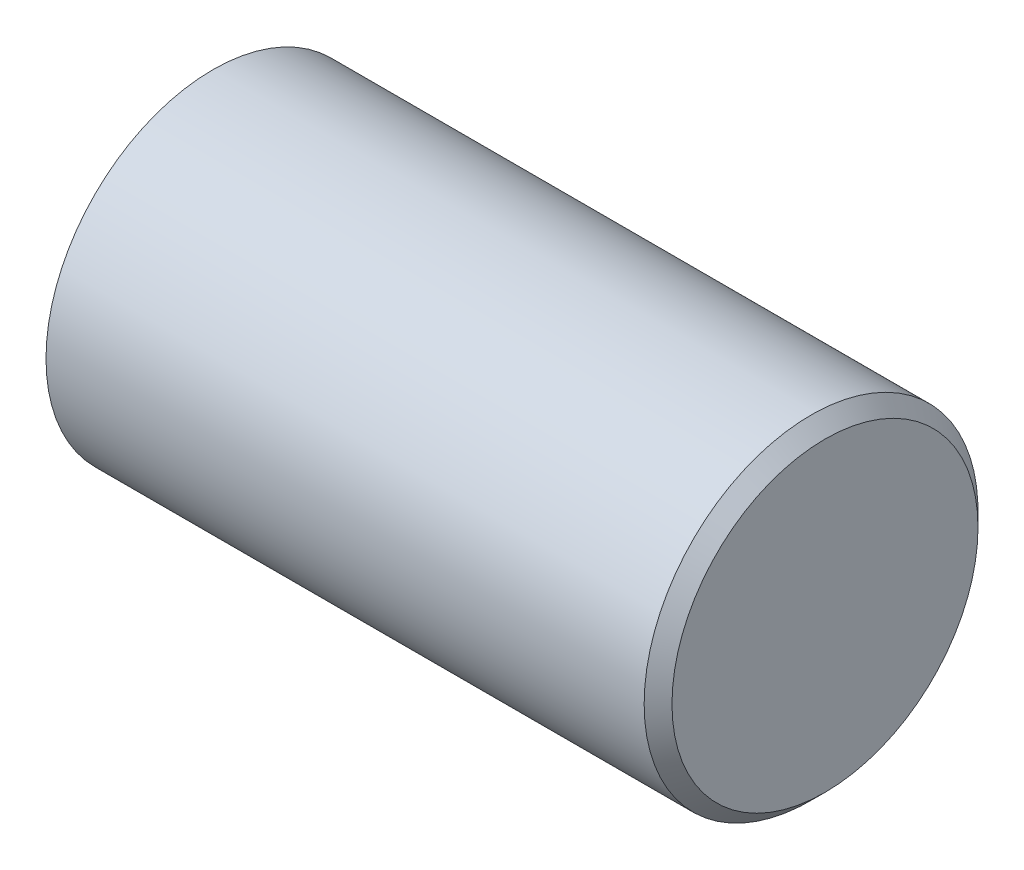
from build123d import *

# Parameters (mm, degrees)
CHANFREIN1_SIZE = 0.5


with BuildPart() as part:
    # Esquisse1 → R_volution1 (revolve)
    with BuildSketch(Plane.XY):
        with BuildLine():
            Line((0, 0), (24, 0))
            Line((24, 0), (24, 6))
            Line((24, 6), (2, 6))
            ThreePointArc((2, 6), (0.513167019, 3.16227766), (0, 0))
        make_face()
    revolve(axis=Axis((0, 0, 0), (1, 0, 0)))

    # Chanfrein1
    chanfrein1_edges = [part.edges().sort_by_distance(p)[0] for p in [
        (24, -6, 0),
    ]]
    chamfer(chanfrein1_edges, length=CHANFREIN1_SIZE)


solid = part.part
